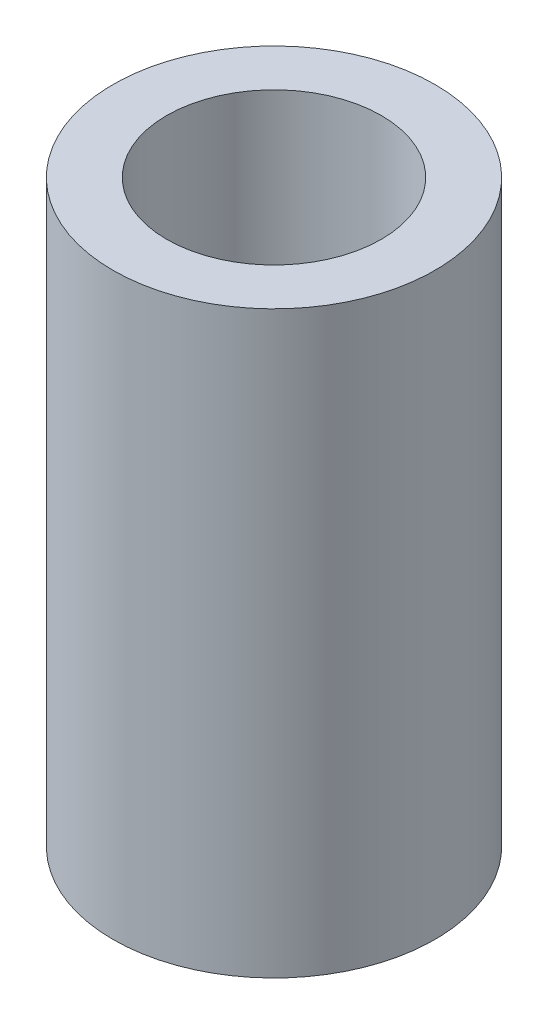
ISO-10303-21;
HEADER;
FILE_DESCRIPTION(('STEP AP214'),'2;1');
FILE_NAME('part.step','',(''),(''),'','','');
FILE_SCHEMA(('AUTOMOTIVE_DESIGN { 1 0 10303 214 1 1 1 1 }'));
ENDSEC;
DATA;
#1=APPLICATION_CONTEXT('core data for automotive mechanical design processes');
#2=APPLICATION_PROTOCOL_DEFINITION('international standard','automotive_design',2000,#1);
#3=PRODUCT_CONTEXT('',#1,'mechanical');
#4=PRODUCT('Part','Part','',(#3));
#5=PRODUCT_RELATED_PRODUCT_CATEGORY('part','',(#4));
#6=PRODUCT_DEFINITION_FORMATION('','',#4);
#7=PRODUCT_DEFINITION_CONTEXT('part definition',#1,'design');
#8=PRODUCT_DEFINITION('design','',#6,#7);
#9=PRODUCT_DEFINITION_SHAPE('','',#8);
#10=(LENGTH_UNIT() NAMED_UNIT(*) SI_UNIT(.MILLI.,.METRE.));
#11=(NAMED_UNIT(*) PLANE_ANGLE_UNIT() SI_UNIT($,.RADIAN.));
#12=(NAMED_UNIT(*) SI_UNIT($,.STERADIAN.) SOLID_ANGLE_UNIT());
#13=UNCERTAINTY_MEASURE_WITH_UNIT(LENGTH_MEASURE(1.E-05),#10,'distance_accuracy_value','');
#14=(GEOMETRIC_REPRESENTATION_CONTEXT(3) GLOBAL_UNCERTAINTY_ASSIGNED_CONTEXT((#13)) GLOBAL_UNIT_ASSIGNED_CONTEXT((#10,
#11,#12)) REPRESENTATION_CONTEXT('',''));
#15=CARTESIAN_POINT('',(0.,0.,0.));
#16=DIRECTION('',(0.,0.,1.));
#17=DIRECTION('',(1.,0.,0.));
#18=AXIS2_PLACEMENT_3D('',#15,#16,#17);
#19=CARTESIAN_POINT('',(0.,34.29,0.));
#20=DIRECTION('',(0.,1.,0.));
#21=DIRECTION('',(0.,0.,1.));
#22=AXIS2_PLACEMENT_3D('',#19,#20,#21);
#23=PLANE('',#22);
#24=CARTESIAN_POINT('',(0.,34.29,0.));
#25=DIRECTION('',(0.,1.,0.));
#26=DIRECTION('',(0.,0.,1.));
#27=AXIS2_PLACEMENT_3D('',#24,#25,#26);
#28=CIRCLE('',#27,9.525);
#29=CARTESIAN_POINT('',(0.,34.29,9.525));
#30=VERTEX_POINT('',#29);
#31=EDGE_CURVE('E10',#30,#30,#28,.T.);
#32=ORIENTED_EDGE('',*,*,#31,.T.);
#33=EDGE_LOOP('',(#32));
#34=FACE_BOUND('',#33,.T.);
#35=CARTESIAN_POINT('',(0.,34.29,0.));
#36=DIRECTION('',(0.,1.,0.));
#37=DIRECTION('',(0.,0.,1.));
#38=AXIS2_PLACEMENT_3D('',#35,#36,#37);
#39=CIRCLE('',#38,6.35);
#40=CARTESIAN_POINT('',(0.,34.29,6.35));
#41=VERTEX_POINT('',#40);
#42=EDGE_CURVE('E41',#41,#41,#39,.T.);
#43=ORIENTED_EDGE('',*,*,#42,.F.);
#44=EDGE_LOOP('',(#43));
#45=FACE_BOUND('',#44,.T.);
#46=ADVANCED_FACE('F30',(#34,#45),#23,.T.);
#47=CARTESIAN_POINT('',(0.,0.,0.));
#48=DIRECTION('',(0.,1.,0.));
#49=DIRECTION('',(0.,0.,1.));
#50=AXIS2_PLACEMENT_3D('',#47,#48,#49);
#51=PLANE('',#50);
#52=CARTESIAN_POINT('',(0.,0.,0.));
#53=DIRECTION('',(0.,1.,0.));
#54=DIRECTION('',(0.,0.,1.));
#55=AXIS2_PLACEMENT_3D('',#52,#53,#54);
#56=CIRCLE('',#55,9.525);
#57=CARTESIAN_POINT('',(0.,0.,9.525));
#58=VERTEX_POINT('',#57);
#59=EDGE_CURVE('E34',#58,#58,#56,.T.);
#60=ORIENTED_EDGE('',*,*,#59,.F.);
#61=EDGE_LOOP('',(#60));
#62=FACE_BOUND('',#61,.T.);
#63=CARTESIAN_POINT('',(0.,0.,0.));
#64=DIRECTION('',(0.,1.,0.));
#65=DIRECTION('',(0.,0.,1.));
#66=AXIS2_PLACEMENT_3D('',#63,#64,#65);
#67=CIRCLE('',#66,6.35);
#68=CARTESIAN_POINT('',(0.,0.,6.35));
#69=VERTEX_POINT('',#68);
#70=EDGE_CURVE('E43',#69,#69,#67,.T.);
#71=ORIENTED_EDGE('',*,*,#70,.T.);
#72=EDGE_LOOP('',(#71));
#73=FACE_BOUND('',#72,.T.);
#74=ADVANCED_FACE('F53',(#62,#73),#51,.F.);
#75=CARTESIAN_POINT('',(0.,34.29,0.));
#76=DIRECTION('',(0.,-1.,0.));
#77=DIRECTION('',(0.,0.,-1.));
#78=AXIS2_PLACEMENT_3D('',#75,#76,#77);
#79=CYLINDRICAL_SURFACE('',#78,9.525);
#80=ORIENTED_EDGE('',*,*,#31,.F.);
#81=EDGE_LOOP('',(#80));
#82=FACE_BOUND('',#81,.T.);
#83=ORIENTED_EDGE('',*,*,#59,.T.);
#84=EDGE_LOOP('',(#83));
#85=FACE_BOUND('',#84,.T.);
#86=ADVANCED_FACE('F32',(#82,#85),#79,.T.);
#87=CARTESIAN_POINT('',(0.,34.29,0.));
#88=DIRECTION('',(0.,-1.,0.));
#89=DIRECTION('',(0.,0.,-1.));
#90=AXIS2_PLACEMENT_3D('',#87,#88,#89);
#91=CYLINDRICAL_SURFACE('',#90,6.35);
#92=ORIENTED_EDGE('',*,*,#42,.T.);
#93=EDGE_LOOP('',(#92));
#94=FACE_BOUND('',#93,.T.);
#95=ORIENTED_EDGE('',*,*,#70,.F.);
#96=EDGE_LOOP('',(#95));
#97=FACE_BOUND('',#96,.T.);
#98=ADVANCED_FACE('F49',(#94,#97),#91,.F.);
#99=CLOSED_SHELL('',(#46,#74,#86,#98));
#100=MANIFOLD_SOLID_BREP('B2',#99);
#101=ADVANCED_BREP_SHAPE_REPRESENTATION('',(#18,#100),#14);
#102=SHAPE_DEFINITION_REPRESENTATION(#9,#101);
ENDSEC;
END-ISO-10303-21;
